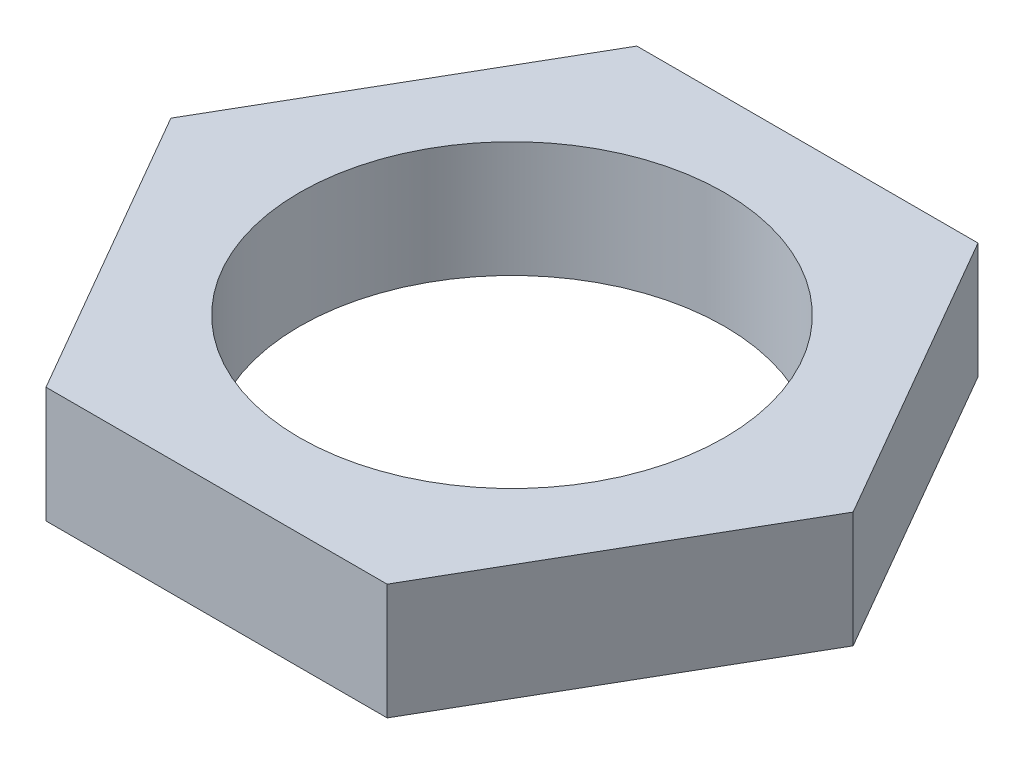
from build123d import *

# Parameters (mm, degrees)
ESQUISSE1_R          = 5.5
BASE_EXTRUSION_DEPTH = 1.5


with BuildPart() as part:
    # Esquisse1 → Base-Extrusion (new, symmetric)
    with BuildSketch(Plane(origin=(0, 0, 0), x_dir=(1, 0, 0), z_dir=(0, 1, 0))):
        Polygon((8.833459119, 0), (4.416729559, 7.65), (-4.416729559, 7.65), (-8.833459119, 0), (-4.416729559, -7.65), (4.416729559, -7.65), align=None)
        with Locations(Location((0, 0, 0), (0, 0, 270))):
            Circle(ESQUISSE1_R, mode=Mode.SUBTRACT)
    extrude(amount=BASE_EXTRUSION_DEPTH, both=True)


solid = part.part
